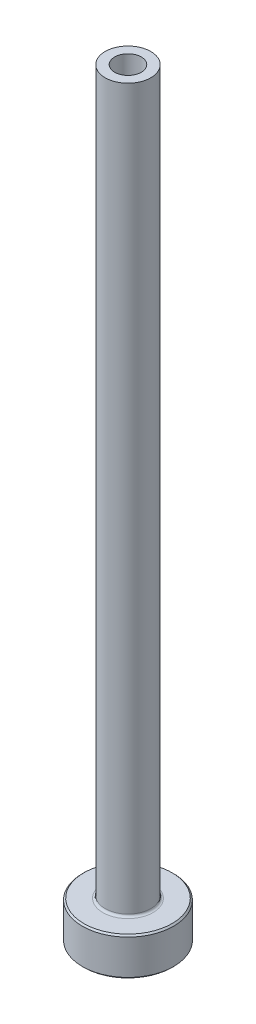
from build123d import *

# Parameters (mm, degrees)
FILLET1_R     = 0.3
CHAMFER1_SIZE = 0.2
CHAMFER3_SIZE = 0.5


with BuildPart() as part:
    # Sketch1 → Revolve1 (revolve)
    with BuildSketch(Plane.XY, mode=Mode.PRIVATE) as revolve1_sk:
        Polygon((-1.75, 100), (-3, 100), (-3, 5), (-6, 5), (-6, 0), (-2, 0), (-2, 43), (-1.75, 55), align=None)
    revolve(revolve1_sk.sketch.rotate(Axis((0, 92.187680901, 0), (0, -1, 0)), 270), axis=Axis((0, 92.187680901, 0), (0, -1, 0)))

    # Fillet1
    fillet1_edges = [part.edges().sort_by_distance(p)[0] for p in [
        (0, 5, -3),
    ]]
    fillet(fillet1_edges, radius=FILLET1_R)

    # Chamfer1
    chamfer1_edges = [part.edges().sort_by_distance(p)[0] for p in [
        (0, 0, -6),
        (0, 5, -6),
    ]]
    chamfer(chamfer1_edges, length=CHAMFER1_SIZE)

    # Chamfer3
    chamfer3_edges = [part.edges().sort_by_distance(p)[0] for p in [
        (0, 0, -2),
    ]]
    chamfer(chamfer3_edges, length=CHAMFER3_SIZE)


solid = part.part
